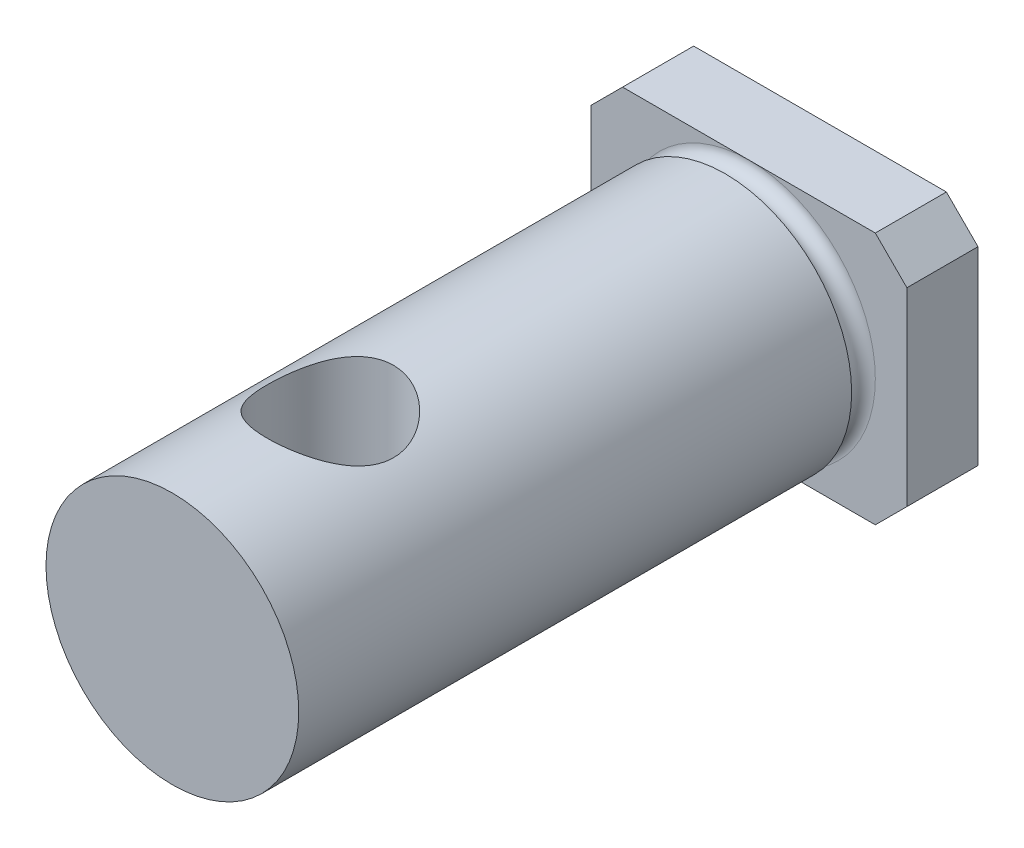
from build123d import *

# Parameters (mm, degrees)
SKETCH1_W                           = 10
SKETCH1_H                           = 8
BOSS_EXTRUDE1_DEPTH                 = 2.25
CHAMFER1_SIZE                       = 1
BOSS_EXTRUDE2_START                 = -2.25
SKETCH2_R                           = 4
BOSS_EXTRUDE2_DEPTH                 = 20.5
SKETCH3_R                           = 0.375
CUT_EXTRUDE1_REACH                  = 23.477
CUT_EXTRUDE1_END_RADIUS             = 4
SKETCH4_R                           = 2
CUT_EXTRUDE1_DIRECTION_2_REACH      = 23.477
CUT_EXTRUDE1_DIRECTION_2_END_RADIUS = 4


with BuildPart() as part:
    # Sketch1 → Boss-Extrude1 (new body)
    with BuildSketch(Plane.XY):
        Rectangle(SKETCH1_W, SKETCH1_H)
    extrude(amount=BOSS_EXTRUDE1_DEPTH)

    # Chamfer1
    chamfer1_edges = [part.edges().sort_by_distance(p)[0] for p in [
        (-5, 4, 1.125),
        (5, 4, 1.125),
        (5, -4, 1.125),
        (-5, -4, 1.125),
    ]]
    chamfer(chamfer1_edges, length=CHAMFER1_SIZE)

    # Sketch2 → Boss-Extrude2 (add)
    with BuildSketch(Plane.XY.offset(2.25).offset(BOSS_EXTRUDE2_START)):
        with Locations(Location((0, 0, 0), (0, 0, 270))):
            Circle(SKETCH2_R)
    extrude(amount=BOSS_EXTRUDE2_DEPTH)

    # Sketch3 → Cut-Revolve1 (revolve, cut)
    with BuildSketch(Plane(origin=(0, 0, 0), x_dir=(1, 0, 0), z_dir=(0, 1, 0)), mode=Mode.PRIVATE) as cut_revolve1_sk:
        with Locations((-4, -2.625)):
            Circle(SKETCH3_R)
    revolve(cut_revolve1_sk.sketch.rotate(Axis((0, 0, 2.625), (0, 0, -1)), 270), axis=Axis((0, 0, 2.625), (0, 0, -1)), mode=Mode.SUBTRACT)

    # Cut-Extrude1: up to this cylinder (the profile starts inside it)
    cut_extrude1_end = Plane(origin=(0, 0, 15.5), z_dir=(0, 0, -1)) * Cylinder(CUT_EXTRUDE1_END_RADIUS, 55.954, mode=Mode.PRIVATE)
    # Sketch4 → Cut-Extrude1 (cut, up to the surface)
    with BuildSketch(Plane(origin=(0, 0, 0), x_dir=(1, 0, 0), z_dir=(0, 1, 0)), mode=Mode.PRIVATE) as cut_extrude1_sk1:
        with Locations(Location((0, -15.5, 0), (0, 0, 90))):
            Circle(SKETCH4_R)
    cut_extrude1_tool1 = extrude(cut_extrude1_sk1.sketch, amount=-CUT_EXTRUDE1_REACH, mode=Mode.PRIVATE) & cut_extrude1_end
    add(cut_extrude1_tool1.solids().sort_by_distance((0, 0, 15.5))[0], mode=Mode.SUBTRACT)

    # Cut-Extrude1 direction 2: up to this cylinder (the profile starts inside it)
    cut_extrude1_direction_2_end = Plane(origin=(0, 0, 15.5), z_dir=(0, 0, -1)) * Cylinder(CUT_EXTRUDE1_DIRECTION_2_END_RADIUS, 55.954, mode=Mode.PRIVATE)
    # Sketch4 → Cut-Extrude1 direction 2 (cut, up to the surface)
    with BuildSketch(Plane(origin=(0, 0, 0), x_dir=(1, 0, 0), z_dir=(0, 1, 0)), mode=Mode.PRIVATE) as cut_extrude1_direction_2_sk1:
        with Locations(Location((0, -15.5, 0), (0, 0, 90))):
            Circle(SKETCH4_R)
    cut_extrude1_direction_2_tool1 = extrude(cut_extrude1_direction_2_sk1.sketch, amount=CUT_EXTRUDE1_DIRECTION_2_REACH, mode=Mode.PRIVATE) & cut_extrude1_direction_2_end
    add(cut_extrude1_direction_2_tool1.solids().sort_by_distance((0, 0, 15.5))[0], mode=Mode.SUBTRACT)


solid = part.part
